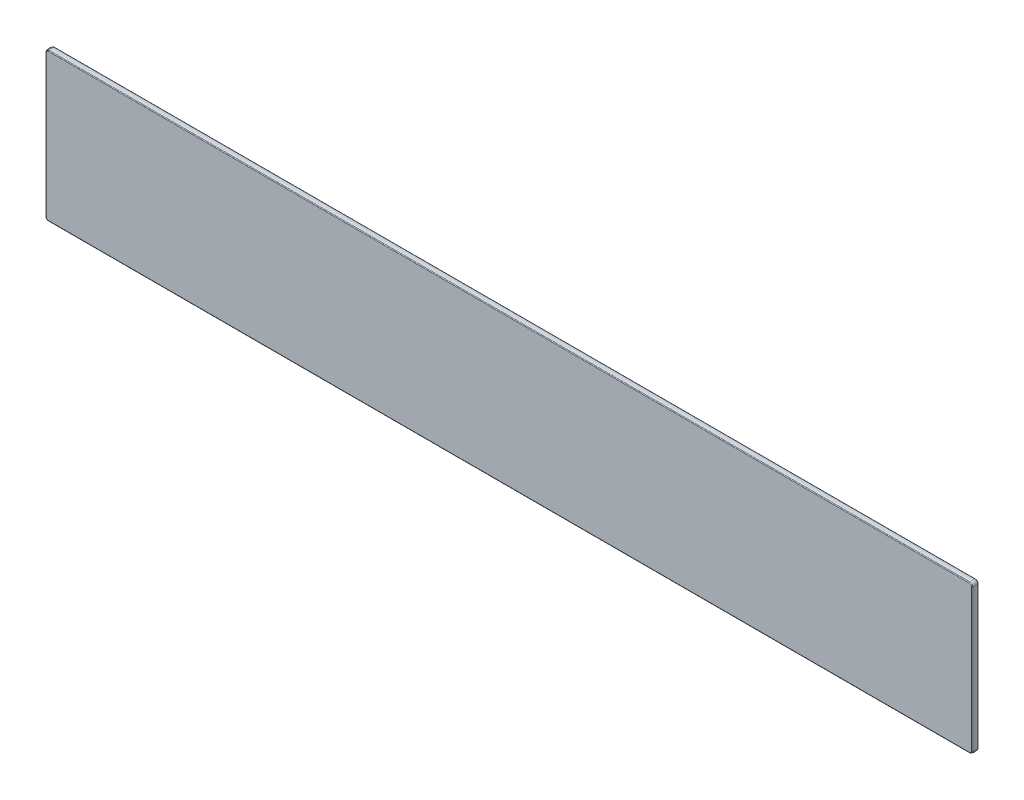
ISO-10303-21;
HEADER;
FILE_DESCRIPTION(('STEP AP214'),'2;1');
FILE_NAME('part.step','',(''),(''),'','','');
FILE_SCHEMA(('AUTOMOTIVE_DESIGN { 1 0 10303 214 1 1 1 1 }'));
ENDSEC;
DATA;
#1=APPLICATION_CONTEXT('core data for automotive mechanical design processes');
#2=APPLICATION_PROTOCOL_DEFINITION('international standard','automotive_design',2000,#1);
#3=PRODUCT_CONTEXT('',#1,'mechanical');
#4=PRODUCT('Part','Part','',(#3));
#5=PRODUCT_RELATED_PRODUCT_CATEGORY('part','',(#4));
#6=PRODUCT_DEFINITION_FORMATION('','',#4);
#7=PRODUCT_DEFINITION_CONTEXT('part definition',#1,'design');
#8=PRODUCT_DEFINITION('design','',#6,#7);
#9=PRODUCT_DEFINITION_SHAPE('','',#8);
#10=(LENGTH_UNIT() NAMED_UNIT(*) SI_UNIT(.MILLI.,.METRE.));
#11=(NAMED_UNIT(*) PLANE_ANGLE_UNIT() SI_UNIT($,.RADIAN.));
#12=(NAMED_UNIT(*) SI_UNIT($,.STERADIAN.) SOLID_ANGLE_UNIT());
#13=UNCERTAINTY_MEASURE_WITH_UNIT(LENGTH_MEASURE(1.E-05),#10,'distance_accuracy_value','');
#14=(GEOMETRIC_REPRESENTATION_CONTEXT(3) GLOBAL_UNCERTAINTY_ASSIGNED_CONTEXT((#13)) GLOBAL_UNIT_ASSIGNED_CONTEXT((#10,
#11,#12)) REPRESENTATION_CONTEXT('',''));
#15=CARTESIAN_POINT('',(0.,0.,0.));
#16=DIRECTION('',(0.,0.,1.));
#17=DIRECTION('',(1.,0.,0.));
#18=AXIS2_PLACEMENT_3D('',#15,#16,#17);
#19=CARTESIAN_POINT('',(0.000262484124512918,-104.420684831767,261.128074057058));
#20=DIRECTION('',(-3.16923956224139E-08,3.73783141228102E-09,1.));
#21=DIRECTION('',(-0.999999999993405,3.63158778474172E-06,-3.16924091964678E-08));
#22=AXIS2_PLACEMENT_3D('',#19,#20,#21);
#23=PLANE('',#22);
#24=CARTESIAN_POINT('',(294.500469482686,-47.4217543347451,261.128083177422));
#25=DIRECTION('',(-3.16923956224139E-08,3.73783141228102E-09,1.));
#26=DIRECTION('',(-3.63158778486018E-06,-0.999999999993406,3.73771631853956E-09));
#27=AXIS2_PLACEMENT_3D('',#24,#25,#26);
#28=CIRCLE('',#27,1.32455532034);
#29=CARTESIAN_POINT('',(295.825024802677,-47.421759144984,261.128083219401));
#30=VERTEX_POINT('',#29);
#31=CARTESIAN_POINT('',(294.500474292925,-46.0971990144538,261.128083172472));
#32=VERTEX_POINT('',#31);
#33=EDGE_CURVE('E37',#30,#32,#28,.T.);
#34=ORIENTED_EDGE('',*,*,#33,.F.);
#35=DIRECTION('',(-3.63158778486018E-06,-0.999999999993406,3.73771631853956E-09));
#36=VECTOR('',#35,1.);
#37=CARTESIAN_POINT('',(295.824859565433,-92.921759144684,261.128083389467));
#38=LINE('',#37,#36);
#39=CARTESIAN_POINT('',(295.824694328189,-138.421759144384,261.128083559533));
#40=VERTEX_POINT('',#39);
#41=EDGE_CURVE('E11',#30,#40,#38,.T.);
#42=ORIENTED_EDGE('',*,*,#41,.T.);
#43=CARTESIAN_POINT('',(294.500139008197,-138.421754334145,261.128083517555));
#44=DIRECTION('',(-3.16923956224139E-08,3.73783141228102E-09,1.));
#45=DIRECTION('',(-3.63158778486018E-06,-0.999999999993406,3.73771631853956E-09));
#46=AXIS2_PLACEMENT_3D('',#43,#44,#45);
#47=CIRCLE('',#46,1.32455532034);
#48=CARTESIAN_POINT('',(294.500134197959,-139.746309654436,261.128083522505));
#49=VERTEX_POINT('',#48);
#50=EDGE_CURVE('E281',#49,#40,#47,.T.);
#51=ORIENTED_EDGE('',*,*,#50,.F.);
#52=DIRECTION('',(-0.999999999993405,3.63158778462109E-06,-3.16924091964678E-08));
#53=VECTOR('',#52,1.);
#54=CARTESIAN_POINT('',(0.000134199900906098,-139.745240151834,261.128074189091));
#55=LINE('',#54,#53);
#56=CARTESIAN_POINT('',(-294.499865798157,-139.744170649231,261.128064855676));
#57=VERTEX_POINT('',#56);
#58=EDGE_CURVE('E29',#49,#57,#55,.T.);
#59=ORIENTED_EDGE('',*,*,#58,.T.);
#60=CARTESIAN_POINT('',(-294.499860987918,-138.41961532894,261.128064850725));
#61=DIRECTION('',(-3.16923956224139E-08,3.73783141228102E-09,1.));
#62=DIRECTION('',(-3.63158778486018E-06,-0.999999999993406,3.73771631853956E-09));
#63=AXIS2_PLACEMENT_3D('',#60,#61,#62);
#64=CIRCLE('',#63,1.32455532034);
#65=CARTESIAN_POINT('',(-295.824416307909,-138.419610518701,261.128064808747));
#66=VERTEX_POINT('',#65);
#67=EDGE_CURVE('E263',#66,#57,#64,.T.);
#68=ORIENTED_EDGE('',*,*,#67,.F.);
#69=DIRECTION('',(3.63158778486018E-06,0.999999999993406,-3.73771631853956E-09));
#70=VECTOR('',#69,1.);
#71=CARTESIAN_POINT('',(-295.824251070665,-92.9196105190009,261.128064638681));
#72=LINE('',#71,#70);
#73=CARTESIAN_POINT('',(-295.824085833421,-47.4196105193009,261.128064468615));
#74=VERTEX_POINT('',#73);
#75=EDGE_CURVE('E288',#66,#74,#72,.T.);
#76=ORIENTED_EDGE('',*,*,#75,.T.);
#77=CARTESIAN_POINT('',(-294.49953051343,-47.4196153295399,261.128064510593));
#78=DIRECTION('',(-3.16923956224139E-08,3.73783141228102E-09,1.));
#79=DIRECTION('',(-3.63158778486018E-06,-0.999999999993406,3.73771631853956E-09));
#80=AXIS2_PLACEMENT_3D('',#77,#78,#79);
#81=CIRCLE('',#80,1.32455532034);
#82=CARTESIAN_POINT('',(-294.49952570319,-46.0950600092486,261.128064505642));
#83=VERTEX_POINT('',#82);
#84=EDGE_CURVE('E294',#83,#74,#81,.T.);
#85=ORIENTED_EDGE('',*,*,#84,.F.);
#86=DIRECTION('',(0.999999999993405,-3.63158778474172E-06,3.16924091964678E-08));
#87=VECTOR('',#86,1.);
#88=CARTESIAN_POINT('',(0.000474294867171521,-46.0961295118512,261.128073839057));
#89=LINE('',#88,#87);
#90=EDGE_CURVE('E293',#83,#32,#89,.T.);
#91=ORIENTED_EDGE('',*,*,#90,.T.);
#92=EDGE_LOOP('',(#34,#42,#51,#59,#68,#76,#85,#91));
#93=FACE_BOUND('',#92,.T.);
#94=ADVANCED_FACE('F17',(#93),#23,.F.);
#95=CARTESIAN_POINT('',(0.000262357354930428,-104.420684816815,265.128074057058));
#96=DIRECTION('',(-3.16923956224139E-08,3.73783141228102E-09,1.));
#97=DIRECTION('',(-0.999999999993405,3.63158778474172E-06,-3.16924091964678E-08));
#98=AXIS2_PLACEMENT_3D('',#95,#96,#97);
#99=PLANE('',#98);
#100=DIRECTION('',(0.999999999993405,-3.63158778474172E-06,3.16924091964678E-08));
#101=VECTOR('',#100,1.);
#102=CARTESIAN_POINT('',(0.000474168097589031,-46.0961294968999,265.128073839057));
#103=LINE('',#102,#101);
#104=CARTESIAN_POINT('',(-294.49952582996,-46.0950599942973,265.128064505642));
#105=VERTEX_POINT('',#104);
#106=CARTESIAN_POINT('',(294.500474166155,-46.0971989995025,265.128083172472));
#107=VERTEX_POINT('',#106);
#108=EDGE_CURVE('E302',#105,#107,#103,.T.);
#109=ORIENTED_EDGE('',*,*,#108,.F.);
#110=CARTESIAN_POINT('',(-294.499530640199,-47.4196153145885,265.128064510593));
#111=DIRECTION('',(-3.16923956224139E-08,3.73783141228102E-09,1.));
#112=DIRECTION('',(-3.63158778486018E-06,-0.999999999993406,3.73771631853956E-09));
#113=AXIS2_PLACEMENT_3D('',#110,#111,#112);
#114=CIRCLE('',#113,1.32455532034);
#115=CARTESIAN_POINT('',(-295.82408596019,-47.4196105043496,265.128064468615));
#116=VERTEX_POINT('',#115);
#117=EDGE_CURVE('E301',#105,#116,#114,.T.);
#118=ORIENTED_EDGE('',*,*,#117,.T.);
#119=DIRECTION('',(3.63158778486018E-06,0.999999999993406,-3.73771631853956E-09));
#120=VECTOR('',#119,1.);
#121=CARTESIAN_POINT('',(-295.824251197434,-92.9196105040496,265.128064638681));
#122=LINE('',#121,#120);
#123=CARTESIAN_POINT('',(-295.824416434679,-138.41961050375,265.128064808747));
#124=VERTEX_POINT('',#123);
#125=EDGE_CURVE('E311',#124,#116,#122,.T.);
#126=ORIENTED_EDGE('',*,*,#125,.F.);
#127=CARTESIAN_POINT('',(-294.499861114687,-138.419615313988,265.128064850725));
#128=DIRECTION('',(-3.16923956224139E-08,3.73783141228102E-09,1.));
#129=DIRECTION('',(-3.63158778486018E-06,-0.999999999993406,3.73771631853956E-09));
#130=AXIS2_PLACEMENT_3D('',#127,#128,#129);
#131=CIRCLE('',#130,1.32455532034);
#132=CARTESIAN_POINT('',(-294.499865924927,-139.74417063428,265.128064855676));
#133=VERTEX_POINT('',#132);
#134=EDGE_CURVE('E310',#124,#133,#131,.T.);
#135=ORIENTED_EDGE('',*,*,#134,.T.);
#136=DIRECTION('',(-0.999999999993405,3.63158778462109E-06,-3.16924091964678E-08));
#137=VECTOR('',#136,1.);
#138=CARTESIAN_POINT('',(0.000134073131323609,-139.745240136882,265.128074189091));
#139=LINE('',#138,#137);
#140=CARTESIAN_POINT('',(294.500134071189,-139.746309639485,265.128083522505));
#141=VERTEX_POINT('',#140);
#142=EDGE_CURVE('E169',#141,#133,#139,.T.);
#143=ORIENTED_EDGE('',*,*,#142,.F.);
#144=CARTESIAN_POINT('',(294.500138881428,-138.421754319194,265.128083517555));
#145=DIRECTION('',(-3.16923956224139E-08,3.73783141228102E-09,1.));
#146=DIRECTION('',(-3.63158778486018E-06,-0.999999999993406,3.73771631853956E-09));
#147=AXIS2_PLACEMENT_3D('',#144,#145,#146);
#148=CIRCLE('',#147,1.32455532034);
#149=CARTESIAN_POINT('',(295.82469420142,-138.421759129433,265.128083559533));
#150=VERTEX_POINT('',#149);
#151=EDGE_CURVE('E318',#141,#150,#148,.T.);
#152=ORIENTED_EDGE('',*,*,#151,.T.);
#153=DIRECTION('',(-3.63158778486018E-06,-0.999999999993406,3.73771631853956E-09));
#154=VECTOR('',#153,1.);
#155=CARTESIAN_POINT('',(295.824859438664,-92.9217591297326,265.128083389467));
#156=LINE('',#155,#154);
#157=CARTESIAN_POINT('',(295.825024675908,-47.4217591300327,265.128083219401));
#158=VERTEX_POINT('',#157);
#159=EDGE_CURVE('E166',#158,#150,#156,.T.);
#160=ORIENTED_EDGE('',*,*,#159,.F.);
#161=CARTESIAN_POINT('',(294.500469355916,-47.4217543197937,265.128083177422));
#162=DIRECTION('',(-3.16923956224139E-08,3.73783141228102E-09,1.));
#163=DIRECTION('',(-3.63158778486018E-06,-0.999999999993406,3.73771631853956E-09));
#164=AXIS2_PLACEMENT_3D('',#161,#162,#163);
#165=CIRCLE('',#164,1.32455532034);
#166=EDGE_CURVE('E204',#158,#107,#165,.T.);
#167=ORIENTED_EDGE('',*,*,#166,.T.);
#168=EDGE_LOOP('',(#109,#118,#126,#135,#143,#152,#160,#167));
#169=FACE_BOUND('',#168,.T.);
#170=ADVANCED_FACE('F642',(#169),#99,.T.);
#171=CARTESIAN_POINT('',(-294.499530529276,-47.4196153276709,261.628064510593));
#172=DIRECTION('',(-3.16923956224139E-08,3.73783141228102E-09,1.));
#173=DIRECTION('',(-3.63158778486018E-06,-0.999999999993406,3.73771631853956E-09));
#174=AXIS2_PLACEMENT_3D('',#171,#172,#173);
#175=TOROIDAL_SURFACE('',#174,1.32455532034,0.5);
#176=CARTESIAN_POINT('',(-294.499530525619,-47.4196153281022,261.512679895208));
#177=DIRECTION('',(-3.16923956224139E-08,3.73783141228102E-09,1.));
#178=DIRECTION('',(-3.63158778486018E-06,-0.999999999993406,3.73771631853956E-09));
#179=AXIS2_PLACEMENT_3D('',#176,#177,#178);
#180=CIRCLE('',#179,1.81105957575);
#181=CARTESIAN_POINT('',(-294.499523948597,-45.6085557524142,261.512679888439));
#182=VERTEX_POINT('',#181);
#183=CARTESIAN_POINT('',(-296.310590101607,-47.4196087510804,261.512679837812));
#184=VERTEX_POINT('',#183);
#185=EDGE_CURVE('E149',#182,#184,#180,.T.);
#186=ORIENTED_EDGE('',*,*,#185,.F.);
#187=CARTESIAN_POINT('',(-294.499525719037,-46.0950600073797,261.628064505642));
#188=DIRECTION('',(-0.999999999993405,3.63158778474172E-06,-3.16924091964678E-08));
#189=DIRECTION('',(-3.16923956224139E-08,3.73783141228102E-09,1.));
#190=AXIS2_PLACEMENT_3D('',#187,#188,#189);
#191=CIRCLE('',#190,0.5);
#192=EDGE_CURVE('E297',#182,#83,#191,.T.);
#193=ORIENTED_EDGE('',*,*,#192,.T.);
#194=ORIENTED_EDGE('',*,*,#84,.T.);
#195=CARTESIAN_POINT('',(-295.824085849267,-47.419610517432,261.628064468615));
#196=DIRECTION('',(-3.63158777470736E-06,-0.999999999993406,3.73771631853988E-09));
#197=DIRECTION('',(-3.16923956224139E-08,3.73783141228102E-09,1.));
#198=AXIS2_PLACEMENT_3D('',#195,#196,#197);
#199=CIRCLE('',#198,0.5);
#200=EDGE_CURVE('E298',#184,#74,#199,.T.);
#201=ORIENTED_EDGE('',*,*,#200,.F.);
#202=EDGE_LOOP('',(#186,#193,#194,#201));
#203=FACE_BOUND('',#202,.T.);
#204=ADVANCED_FACE('F628',(#203),#175,.T.);
#205=CARTESIAN_POINT('',(-295.824251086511,-92.919610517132,261.628064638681));
#206=DIRECTION('',(3.63158778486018E-06,0.999999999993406,-3.73771631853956E-09));
#207=DIRECTION('',(-3.16923956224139E-08,3.73783141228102E-09,1.));
#208=AXIS2_PLACEMENT_3D('',#205,#206,#207);
#209=CYLINDRICAL_SURFACE('',#208,0.5);
#210=ORIENTED_EDGE('',*,*,#200,.T.);
#211=ORIENTED_EDGE('',*,*,#75,.F.);
#212=CARTESIAN_POINT('',(-295.824416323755,-138.419610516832,261.628064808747));
#213=DIRECTION('',(-3.63158778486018E-06,-0.999999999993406,3.73771631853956E-09));
#214=DIRECTION('',(-3.16923956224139E-08,3.73783141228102E-09,1.));
#215=AXIS2_PLACEMENT_3D('',#212,#213,#214);
#216=CIRCLE('',#215,0.5);
#217=CARTESIAN_POINT('',(-296.310920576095,-138.41960875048,261.512680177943));
#218=VERTEX_POINT('',#217);
#219=EDGE_CURVE('E270',#218,#66,#216,.T.);
#220=ORIENTED_EDGE('',*,*,#219,.F.);
#221=DIRECTION('',(3.63158778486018E-06,0.999999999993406,-3.73771631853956E-09));
#222=VECTOR('',#221,1.);
#223=CARTESIAN_POINT('',(-296.310755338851,-92.9196087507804,261.512680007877));
#224=LINE('',#223,#222);
#225=EDGE_CURVE('E526',#218,#184,#224,.T.);
#226=ORIENTED_EDGE('',*,*,#225,.T.);
#227=EDGE_LOOP('',(#210,#211,#220,#226));
#228=FACE_BOUND('',#227,.T.);
#229=ADVANCED_FACE('F625',(#228),#209,.T.);
#230=CARTESIAN_POINT('',(0.00047427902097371,-46.0961295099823,261.628073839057));
#231=DIRECTION('',(0.999999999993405,-3.63158778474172E-06,3.16924091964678E-08));
#232=DIRECTION('',(-3.16923956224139E-08,3.73783141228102E-09,1.));
#233=AXIS2_PLACEMENT_3D('',#230,#231,#232);
#234=CYLINDRICAL_SURFACE('',#233,0.5);
#235=CARTESIAN_POINT('',(294.500474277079,-46.0971990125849,261.628083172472));
#236=DIRECTION('',(-0.999999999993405,3.63158778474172E-06,-3.16924091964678E-08));
#237=DIRECTION('',(-3.16923956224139E-08,3.73783141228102E-09,1.));
#238=AXIS2_PLACEMENT_3D('',#235,#236,#237);
#239=CIRCLE('',#238,0.5);
#240=CARTESIAN_POINT('',(294.500476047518,-45.6106947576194,261.512698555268));
#241=VERTEX_POINT('',#240);
#242=EDGE_CURVE('E520',#241,#32,#239,.T.);
#243=ORIENTED_EDGE('',*,*,#242,.T.);
#244=ORIENTED_EDGE('',*,*,#90,.F.);
#245=ORIENTED_EDGE('',*,*,#192,.F.);
#246=DIRECTION('',(0.999999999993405,-3.63158778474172E-06,3.16924091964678E-08));
#247=VECTOR('',#246,1.);
#248=CARTESIAN_POINT('',(0.000476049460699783,-45.6096252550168,261.512689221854));
#249=LINE('',#248,#247);
#250=EDGE_CURVE('E517',#182,#241,#249,.T.);
#251=ORIENTED_EDGE('',*,*,#250,.T.);
#252=EDGE_LOOP('',(#243,#244,#245,#251));
#253=FACE_BOUND('',#252,.T.);
#254=ADVANCED_FACE('F654',(#253),#234,.T.);
#255=CARTESIAN_POINT('',(-294.499861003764,-138.419615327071,261.628064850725));
#256=DIRECTION('',(-3.16923956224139E-08,3.73783141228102E-09,1.));
#257=DIRECTION('',(0.999999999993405,-3.63158778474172E-06,3.16924091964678E-08));
#258=AXIS2_PLACEMENT_3D('',#255,#256,#257);
#259=TOROIDAL_SURFACE('',#258,1.32455532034,0.5);
#260=CARTESIAN_POINT('',(-294.499861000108,-138.419615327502,261.51268023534));
#261=DIRECTION('',(-3.16923956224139E-08,3.73783141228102E-09,1.));
#262=DIRECTION('',(-3.63158778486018E-06,-0.999999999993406,3.73771631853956E-09));
#263=AXIS2_PLACEMENT_3D('',#260,#261,#262);
#264=CIRCLE('',#263,1.81105957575);
#265=CARTESIAN_POINT('',(-294.499867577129,-140.23067490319,261.512680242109));
#266=VERTEX_POINT('',#265);
#267=EDGE_CURVE('E383',#218,#266,#264,.T.);
#268=ORIENTED_EDGE('',*,*,#267,.F.);
#269=ORIENTED_EDGE('',*,*,#219,.T.);
#270=ORIENTED_EDGE('',*,*,#67,.T.);
#271=CARTESIAN_POINT('',(-294.499865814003,-139.744170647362,261.628064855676));
#272=DIRECTION('',(0.999999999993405,-3.63158779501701E-06,3.16924091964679E-08));
#273=DIRECTION('',(-3.16923956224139E-08,3.73783141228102E-09,1.));
#274=AXIS2_PLACEMENT_3D('',#271,#272,#273);
#275=CIRCLE('',#274,0.5);
#276=EDGE_CURVE('E272',#266,#57,#275,.T.);
#277=ORIENTED_EDGE('',*,*,#276,.F.);
#278=EDGE_LOOP('',(#268,#269,#270,#277));
#279=FACE_BOUND('',#278,.T.);
#280=ADVANCED_FACE('F634',(#279),#259,.T.);
#281=CARTESIAN_POINT('',(294.50046946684,-47.4217543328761,261.628083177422));
#282=DIRECTION('',(-3.16923956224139E-08,3.73783141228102E-09,1.));
#283=DIRECTION('',(-0.999999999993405,3.63158778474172E-06,-3.16924091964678E-08));
#284=AXIS2_PLACEMENT_3D('',#281,#282,#283);
#285=TOROIDAL_SURFACE('',#284,1.32455532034,0.5);
#286=CARTESIAN_POINT('',(294.500469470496,-47.4217543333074,261.512698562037));
#287=DIRECTION('',(-3.16923956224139E-08,3.73783141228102E-09,1.));
#288=DIRECTION('',(-3.63158778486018E-06,-0.999999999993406,3.73771631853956E-09));
#289=AXIS2_PLACEMENT_3D('',#286,#287,#288);
#290=CIRCLE('',#289,1.81105957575);
#291=CARTESIAN_POINT('',(296.311529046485,-47.4217609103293,261.512698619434));
#292=VERTEX_POINT('',#291);
#293=EDGE_CURVE('E506',#292,#241,#290,.T.);
#294=ORIENTED_EDGE('',*,*,#293,.F.);
#295=CARTESIAN_POINT('',(295.825024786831,-47.4217591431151,261.628083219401));
#296=DIRECTION('',(3.63158778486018E-06,0.999999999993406,-3.73771631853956E-09));
#297=DIRECTION('',(3.16923956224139E-08,-3.73783141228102E-09,-1.));
#298=AXIS2_PLACEMENT_3D('',#295,#296,#297);
#299=CIRCLE('',#298,0.5);
#300=EDGE_CURVE('E260',#292,#30,#299,.T.);
#301=ORIENTED_EDGE('',*,*,#300,.T.);
#302=ORIENTED_EDGE('',*,*,#33,.T.);
#303=ORIENTED_EDGE('',*,*,#242,.F.);
#304=EDGE_LOOP('',(#294,#301,#302,#303));
#305=FACE_BOUND('',#304,.T.);
#306=ADVANCED_FACE('F660',(#305),#285,.T.);
#307=CARTESIAN_POINT('',(0.000134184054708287,-139.745240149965,261.628074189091));
#308=DIRECTION('',(-0.999999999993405,3.63158778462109E-06,-3.16924091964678E-08));
#309=DIRECTION('',(-3.16923956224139E-08,3.73783141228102E-09,1.));
#310=AXIS2_PLACEMENT_3D('',#307,#308,#309);
#311=CYLINDRICAL_SURFACE('',#310,0.5);
#312=ORIENTED_EDGE('',*,*,#276,.T.);
#313=ORIENTED_EDGE('',*,*,#58,.F.);
#314=CARTESIAN_POINT('',(294.500134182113,-139.746309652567,261.628083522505));
#315=DIRECTION('',(0.999999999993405,-3.63158778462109E-06,3.16924091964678E-08));
#316=DIRECTION('',(-3.16923956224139E-08,3.73783141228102E-09,1.));
#317=AXIS2_PLACEMENT_3D('',#314,#315,#316);
#318=CIRCLE('',#317,0.5);
#319=CARTESIAN_POINT('',(294.500132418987,-140.232813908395,261.512698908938));
#320=VERTEX_POINT('',#319);
#321=EDGE_CURVE('E284',#320,#49,#318,.T.);
#322=ORIENTED_EDGE('',*,*,#321,.F.);
#323=DIRECTION('',(-0.999999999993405,3.63158778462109E-06,-3.16924091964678E-08));
#324=VECTOR('',#323,1.);
#325=CARTESIAN_POINT('',(0.000132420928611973,-140.231744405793,261.512689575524));
#326=LINE('',#325,#324);
#327=EDGE_CURVE('E278',#320,#266,#326,.T.);
#328=ORIENTED_EDGE('',*,*,#327,.T.);
#329=EDGE_LOOP('',(#312,#313,#322,#328));
#330=FACE_BOUND('',#329,.T.);
#331=ADVANCED_FACE('F663',(#330),#311,.T.);
#332=CARTESIAN_POINT('',(295.824859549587,-92.921759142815,261.628083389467));
#333=DIRECTION('',(-3.63158778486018E-06,-0.999999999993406,3.73771631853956E-09));
#334=DIRECTION('',(-3.16923956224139E-08,3.73783141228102E-09,1.));
#335=AXIS2_PLACEMENT_3D('',#332,#333,#334);
#336=CYLINDRICAL_SURFACE('',#335,0.5);
#337=CARTESIAN_POINT('',(295.824694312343,-138.421759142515,261.628083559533));
#338=DIRECTION('',(3.63158778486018E-06,0.999999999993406,-3.73771631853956E-09));
#339=DIRECTION('',(3.16923956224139E-08,-3.73783141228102E-09,-1.));
#340=AXIS2_PLACEMENT_3D('',#337,#338,#339);
#341=CIRCLE('',#340,0.5);
#342=CARTESIAN_POINT('',(296.311198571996,-138.421760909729,261.512698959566));
#343=VERTEX_POINT('',#342);
#344=EDGE_CURVE('E346',#343,#40,#341,.T.);
#345=ORIENTED_EDGE('',*,*,#344,.T.);
#346=ORIENTED_EDGE('',*,*,#41,.F.);
#347=ORIENTED_EDGE('',*,*,#300,.F.);
#348=DIRECTION('',(-3.63158778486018E-06,-0.999999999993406,3.73771631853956E-09));
#349=VECTOR('',#348,1.);
#350=CARTESIAN_POINT('',(296.311363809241,-92.9217609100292,261.5126987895));
#351=LINE('',#350,#349);
#352=EDGE_CURVE('E340',#292,#343,#351,.T.);
#353=ORIENTED_EDGE('',*,*,#352,.T.);
#354=EDGE_LOOP('',(#345,#346,#347,#353));
#355=FACE_BOUND('',#354,.T.);
#356=ADVANCED_FACE('F666',(#355),#336,.T.);
#357=CARTESIAN_POINT('',(294.500138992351,-138.421754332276,261.628083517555));
#358=DIRECTION('',(-3.16923956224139E-08,3.73783141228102E-09,1.));
#359=DIRECTION('',(3.63158778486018E-06,0.999999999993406,-3.73771631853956E-09));
#360=AXIS2_PLACEMENT_3D('',#357,#358,#359);
#361=TOROIDAL_SURFACE('',#360,1.32455532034,0.5);
#362=CARTESIAN_POINT('',(294.500138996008,-138.421754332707,261.51269890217));
#363=DIRECTION('',(-3.16923956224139E-08,3.73783141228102E-09,1.));
#364=DIRECTION('',(-3.63158778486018E-06,-0.999999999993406,3.73771631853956E-09));
#365=AXIS2_PLACEMENT_3D('',#362,#363,#364);
#366=CIRCLE('',#365,1.81105957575);
#367=EDGE_CURVE('E173',#320,#343,#366,.T.);
#368=ORIENTED_EDGE('',*,*,#367,.F.);
#369=ORIENTED_EDGE('',*,*,#321,.T.);
#370=ORIENTED_EDGE('',*,*,#50,.T.);
#371=ORIENTED_EDGE('',*,*,#344,.F.);
#372=EDGE_LOOP('',(#368,#369,#370,#371));
#373=FACE_BOUND('',#372,.T.);
#374=ADVANCED_FACE('F670',(#373),#361,.T.);
#375=CARTESIAN_POINT('',(-294.499530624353,-47.4196153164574,264.628064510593));
#376=DIRECTION('',(-3.16923956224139E-08,3.73783141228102E-09,1.));
#377=DIRECTION('',(-3.63158778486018E-06,-0.999999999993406,3.73771631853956E-09));
#378=AXIS2_PLACEMENT_3D('',#375,#376,#377);
#379=TOROIDAL_SURFACE('',#378,1.32455532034,0.5);
#380=ORIENTED_EDGE('',*,*,#117,.F.);
#381=CARTESIAN_POINT('',(-294.499525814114,-46.0950599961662,264.628064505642));
#382=DIRECTION('',(-0.999999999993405,3.63158778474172E-06,-3.16924091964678E-08));
#383=DIRECTION('',(-3.16923956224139E-08,3.73783141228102E-09,1.));
#384=AXIS2_PLACEMENT_3D('',#381,#382,#383);
#385=CIRCLE('',#384,0.5);
#386=CARTESIAN_POINT('',(-294.499524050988,-45.6085557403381,264.743449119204));
#387=VERTEX_POINT('',#386);
#388=EDGE_CURVE('E285',#105,#387,#385,.T.);
#389=ORIENTED_EDGE('',*,*,#388,.T.);
#390=CARTESIAN_POINT('',(-294.499530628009,-47.4196153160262,264.743449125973));
#391=DIRECTION('',(-3.16923956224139E-08,3.73783141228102E-09,1.));
#392=DIRECTION('',(-3.63158778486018E-06,-0.999999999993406,3.73771631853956E-09));
#393=AXIS2_PLACEMENT_3D('',#390,#391,#392);
#394=CIRCLE('',#393,1.81105957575);
#395=CARTESIAN_POINT('',(-296.310590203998,-47.4196087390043,264.743449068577));
#396=VERTEX_POINT('',#395);
#397=EDGE_CURVE('E419',#387,#396,#394,.T.);
#398=ORIENTED_EDGE('',*,*,#397,.T.);
#399=CARTESIAN_POINT('',(-295.824085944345,-47.4196105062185,264.628064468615));
#400=DIRECTION('',(-3.63158777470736E-06,-0.999999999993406,3.73771631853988E-09));
#401=DIRECTION('',(-3.16923956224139E-08,3.73783141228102E-09,1.));
#402=AXIS2_PLACEMENT_3D('',#399,#400,#401);
#403=CIRCLE('',#402,0.5);
#404=EDGE_CURVE('E314',#116,#396,#403,.T.);
#405=ORIENTED_EDGE('',*,*,#404,.F.);
#406=EDGE_LOOP('',(#380,#389,#398,#405));
#407=FACE_BOUND('',#406,.T.);
#408=ADVANCED_FACE('F674',(#407),#379,.T.);
#409=CARTESIAN_POINT('',(-295.824251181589,-92.9196105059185,264.628064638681));
#410=DIRECTION('',(3.63158778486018E-06,0.999999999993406,-3.73771631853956E-09));
#411=DIRECTION('',(0.973008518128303,-3.53442839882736E-06,-0.230769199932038));
#412=AXIS2_PLACEMENT_3D('',#409,#410,#411);
#413=CYLINDRICAL_SURFACE('',#412,0.5);
#414=ORIENTED_EDGE('',*,*,#404,.T.);
#415=DIRECTION('',(3.63158778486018E-06,0.999999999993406,-3.73771631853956E-09));
#416=VECTOR('',#415,1.);
#417=CARTESIAN_POINT('',(-296.310755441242,-92.9196087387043,264.743449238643));
#418=LINE('',#417,#416);
#419=CARTESIAN_POINT('',(-296.310920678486,-138.419608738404,264.743449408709));
#420=VERTEX_POINT('',#419);
#421=EDGE_CURVE('E543',#420,#396,#418,.T.);
#422=ORIENTED_EDGE('',*,*,#421,.F.);
#423=CARTESIAN_POINT('',(-295.824416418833,-138.419610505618,264.628064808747));
#424=DIRECTION('',(-3.63158778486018E-06,-0.999999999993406,3.73771631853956E-09));
#425=DIRECTION('',(-3.16923956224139E-08,3.73783141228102E-09,1.));
#426=AXIS2_PLACEMENT_3D('',#423,#424,#425);
#427=CIRCLE('',#426,0.5);
#428=EDGE_CURVE('E306',#124,#420,#427,.T.);
#429=ORIENTED_EDGE('',*,*,#428,.F.);
#430=ORIENTED_EDGE('',*,*,#125,.T.);
#431=EDGE_LOOP('',(#414,#422,#429,#430));
#432=FACE_BOUND('',#431,.T.);
#433=ADVANCED_FACE('F678',(#432),#413,.T.);
#434=CARTESIAN_POINT('',(0.000474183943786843,-46.0961294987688,264.628073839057));
#435=DIRECTION('',(0.999999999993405,-3.63158778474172E-06,3.16924091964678E-08));
#436=DIRECTION('',(-3.52625219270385E-06,-0.97300851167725,-0.230769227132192));
#437=AXIS2_PLACEMENT_3D('',#434,#435,#436);
#438=CYLINDRICAL_SURFACE('',#437,0.5);
#439=CARTESIAN_POINT('',(294.500474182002,-46.0971990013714,264.628083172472));
#440=DIRECTION('',(-0.999999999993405,3.63158778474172E-06,-3.16924091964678E-08));
#441=DIRECTION('',(-3.16923956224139E-08,3.73783141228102E-09,1.));
#442=AXIS2_PLACEMENT_3D('',#439,#440,#441);
#443=CIRCLE('',#442,0.5);
#444=CARTESIAN_POINT('',(294.500475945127,-45.6106947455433,264.743467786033));
#445=VERTEX_POINT('',#444);
#446=EDGE_CURVE('E305',#107,#445,#443,.T.);
#447=ORIENTED_EDGE('',*,*,#446,.T.);
#448=DIRECTION('',(0.999999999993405,-3.63158778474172E-06,3.16924091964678E-08));
#449=VECTOR('',#448,1.);
#450=CARTESIAN_POINT('',(0.000475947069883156,-45.6096252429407,264.743458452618));
#451=LINE('',#450,#449);
#452=EDGE_CURVE('E387',#387,#445,#451,.T.);
#453=ORIENTED_EDGE('',*,*,#452,.F.);
#454=ORIENTED_EDGE('',*,*,#388,.F.);
#455=ORIENTED_EDGE('',*,*,#108,.T.);
#456=EDGE_LOOP('',(#447,#453,#454,#455));
#457=FACE_BOUND('',#456,.T.);
#458=ADVANCED_FACE('F598',(#457),#438,.T.);
#459=CARTESIAN_POINT('',(-294.499861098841,-138.419615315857,264.628064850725));
#460=DIRECTION('',(-3.16923956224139E-08,3.73783141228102E-09,1.));
#461=DIRECTION('',(0.999999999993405,-3.63158778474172E-06,3.16924091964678E-08));
#462=AXIS2_PLACEMENT_3D('',#459,#460,#461);
#463=TOROIDAL_SURFACE('',#462,1.32455532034,0.5);
#464=ORIENTED_EDGE('',*,*,#134,.F.);
#465=ORIENTED_EDGE('',*,*,#428,.T.);
#466=CARTESIAN_POINT('',(-294.499861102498,-138.419615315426,264.743449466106));
#467=DIRECTION('',(-3.16923956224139E-08,3.73783141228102E-09,1.));
#468=DIRECTION('',(-3.63158778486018E-06,-0.999999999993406,3.73771631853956E-09));
#469=AXIS2_PLACEMENT_3D('',#466,#467,#468);
#470=CIRCLE('',#469,1.81105957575);
#471=CARTESIAN_POINT('',(-294.49986767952,-140.230674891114,264.743449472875));
#472=VERTEX_POINT('',#471);
#473=EDGE_CURVE('E257',#420,#472,#470,.T.);
#474=ORIENTED_EDGE('',*,*,#473,.T.);
#475=CARTESIAN_POINT('',(-294.49986590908,-139.744170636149,264.628064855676));
#476=DIRECTION('',(0.999999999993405,-3.63158779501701E-06,3.16924091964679E-08));
#477=DIRECTION('',(-3.16923956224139E-08,3.73783141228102E-09,1.));
#478=AXIS2_PLACEMENT_3D('',#475,#476,#477);
#479=CIRCLE('',#478,0.5);
#480=EDGE_CURVE('E321',#133,#472,#479,.T.);
#481=ORIENTED_EDGE('',*,*,#480,.F.);
#482=EDGE_LOOP('',(#464,#465,#474,#481));
#483=FACE_BOUND('',#482,.T.);
#484=ADVANCED_FACE('F685',(#483),#463,.T.);
#485=CARTESIAN_POINT('',(294.500469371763,-47.4217543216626,264.628083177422));
#486=DIRECTION('',(-3.16923956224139E-08,3.73783141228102E-09,1.));
#487=DIRECTION('',(-0.999999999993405,3.63158778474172E-06,-3.16924091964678E-08));
#488=AXIS2_PLACEMENT_3D('',#485,#486,#487);
#489=TOROIDAL_SURFACE('',#488,1.32455532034,0.5);
#490=ORIENTED_EDGE('',*,*,#166,.F.);
#491=CARTESIAN_POINT('',(295.825024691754,-47.4217591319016,264.628083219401));
#492=DIRECTION('',(3.63158778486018E-06,0.999999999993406,-3.73771631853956E-09));
#493=DIRECTION('',(3.16923956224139E-08,-3.73783141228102E-09,-1.));
#494=AXIS2_PLACEMENT_3D('',#491,#492,#493);
#495=CIRCLE('',#494,0.5);
#496=CARTESIAN_POINT('',(296.311528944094,-47.4217608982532,264.743467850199));
#497=VERTEX_POINT('',#496);
#498=EDGE_CURVE('E248',#158,#497,#495,.T.);
#499=ORIENTED_EDGE('',*,*,#498,.T.);
#500=CARTESIAN_POINT('',(294.500469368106,-47.4217543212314,264.743467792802));
#501=DIRECTION('',(-3.16923956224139E-08,3.73783141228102E-09,1.));
#502=DIRECTION('',(-3.63158778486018E-06,-0.999999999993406,3.73771631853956E-09));
#503=AXIS2_PLACEMENT_3D('',#500,#501,#502);
#504=CIRCLE('',#503,1.81105957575);
#505=EDGE_CURVE('E258',#497,#445,#504,.T.);
#506=ORIENTED_EDGE('',*,*,#505,.T.);
#507=ORIENTED_EDGE('',*,*,#446,.F.);
#508=EDGE_LOOP('',(#490,#499,#506,#507));
#509=FACE_BOUND('',#508,.T.);
#510=ADVANCED_FACE('F603',(#509),#489,.T.);
#511=CARTESIAN_POINT('',(0.00013408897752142,-139.745240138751,264.628074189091));
#512=DIRECTION('',(-0.999999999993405,3.63158778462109E-06,-3.16924091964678E-08));
#513=DIRECTION('',(3.5408794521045E-06,0.973008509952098,-0.230769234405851));
#514=AXIS2_PLACEMENT_3D('',#511,#512,#513);
#515=CYLINDRICAL_SURFACE('',#514,0.5);
#516=ORIENTED_EDGE('',*,*,#480,.T.);
#517=DIRECTION('',(-0.999999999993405,3.63158778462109E-06,-3.16924091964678E-08));
#518=VECTOR('',#517,1.);
#519=CARTESIAN_POINT('',(0.000132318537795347,-140.231744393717,264.743458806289));
#520=LINE('',#519,#518);
#521=CARTESIAN_POINT('',(294.500132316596,-140.232813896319,264.743468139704));
#522=VERTEX_POINT('',#521);
#523=EDGE_CURVE('E129',#522,#472,#520,.T.);
#524=ORIENTED_EDGE('',*,*,#523,.F.);
#525=CARTESIAN_POINT('',(294.500134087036,-139.746309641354,264.628083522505));
#526=DIRECTION('',(0.999999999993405,-3.63158778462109E-06,3.16924091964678E-08));
#527=DIRECTION('',(-3.16923956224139E-08,3.73783141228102E-09,1.));
#528=AXIS2_PLACEMENT_3D('',#525,#526,#527);
#529=CIRCLE('',#528,0.5);
#530=EDGE_CURVE('E158',#141,#522,#529,.T.);
#531=ORIENTED_EDGE('',*,*,#530,.F.);
#532=ORIENTED_EDGE('',*,*,#142,.T.);
#533=EDGE_LOOP('',(#516,#524,#531,#532));
#534=FACE_BOUND('',#533,.T.);
#535=ADVANCED_FACE('F691',(#534),#515,.T.);
#536=CARTESIAN_POINT('',(295.824859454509,-92.9217591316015,264.628083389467));
#537=DIRECTION('',(-3.63158778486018E-06,-0.999999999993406,3.73771631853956E-09));
#538=DIRECTION('',(-0.973008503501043,3.53270324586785E-06,-0.230769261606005));
#539=AXIS2_PLACEMENT_3D('',#536,#537,#538);
#540=CYLINDRICAL_SURFACE('',#539,0.5);
#541=CARTESIAN_POINT('',(295.824694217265,-138.421759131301,264.628083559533));
#542=DIRECTION('',(3.63158778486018E-06,0.999999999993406,-3.73771631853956E-09));
#543=DIRECTION('',(3.16923956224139E-08,-3.73783141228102E-09,-1.));
#544=AXIS2_PLACEMENT_3D('',#541,#542,#543);
#545=CIRCLE('',#544,0.5);
#546=CARTESIAN_POINT('',(296.311198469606,-138.421760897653,264.743468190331));
#547=VERTEX_POINT('',#546);
#548=EDGE_CURVE('E157',#150,#547,#545,.T.);
#549=ORIENTED_EDGE('',*,*,#548,.T.);
#550=DIRECTION('',(-3.63158778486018E-06,-0.999999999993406,3.73771631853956E-09));
#551=VECTOR('',#550,1.);
#552=CARTESIAN_POINT('',(296.31136370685,-92.9217608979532,264.743468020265));
#553=LINE('',#552,#551);
#554=EDGE_CURVE('E135',#497,#547,#553,.T.);
#555=ORIENTED_EDGE('',*,*,#554,.F.);
#556=ORIENTED_EDGE('',*,*,#498,.F.);
#557=ORIENTED_EDGE('',*,*,#159,.T.);
#558=EDGE_LOOP('',(#549,#555,#556,#557));
#559=FACE_BOUND('',#558,.T.);
#560=ADVANCED_FACE('F165',(#559),#540,.T.);
#561=CARTESIAN_POINT('',(294.500138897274,-138.421754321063,264.628083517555));
#562=DIRECTION('',(-3.16923956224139E-08,3.73783141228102E-09,1.));
#563=DIRECTION('',(3.63158778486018E-06,0.999999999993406,-3.73771631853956E-09));
#564=AXIS2_PLACEMENT_3D('',#561,#562,#563);
#565=TOROIDAL_SURFACE('',#564,1.32455532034,0.5);
#566=ORIENTED_EDGE('',*,*,#151,.F.);
#567=ORIENTED_EDGE('',*,*,#530,.T.);
#568=CARTESIAN_POINT('',(294.500138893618,-138.421754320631,264.743468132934));
#569=DIRECTION('',(-3.16923956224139E-08,3.73783141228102E-09,1.));
#570=DIRECTION('',(-3.63158778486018E-06,-0.999999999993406,3.73771631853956E-09));
#571=AXIS2_PLACEMENT_3D('',#568,#569,#570);
#572=CIRCLE('',#571,1.81105957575);
#573=EDGE_CURVE('E154',#522,#547,#572,.T.);
#574=ORIENTED_EDGE('',*,*,#573,.T.);
#575=ORIENTED_EDGE('',*,*,#548,.F.);
#576=EDGE_LOOP('',(#566,#567,#574,#575));
#577=FACE_BOUND('',#576,.T.);
#578=ADVANCED_FACE('F156',(#577),#565,.T.);
#579=CARTESIAN_POINT('',(294.500132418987,-140.232813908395,261.512698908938));
#580=CARTESIAN_POINT('',(294.500131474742,-140.483595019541,262.570084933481));
#581=CARTESIAN_POINT('',(294.500131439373,-140.48359501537,263.686082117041));
#582=CARTESIAN_POINT('',(294.500132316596,-140.232813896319,264.743468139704));
#583=B_SPLINE_CURVE_WITH_KNOTS('',3,(#579,#580,#581,#582),.UNSPECIFIED.,.F.,.F.,(4,4),(0.,1.),.UNSPECIFIED.);
#584=CARTESIAN_POINT('',(294.500138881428,-138.421754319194,265.128083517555));
#585=DIRECTION('',(-3.16923956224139E-08,3.73783141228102E-09,1.));
#586=AXIS1_PLACEMENT('',#584,#585);
#587=SURFACE_OF_REVOLUTION('',#583,#586);
#588=CARTESIAN_POINT('',(294.500132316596,-140.232813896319,264.743468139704));
#589=CARTESIAN_POINT('',(294.500132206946,-140.264160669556,264.611300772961));
#590=CARTESIAN_POINT('',(294.500132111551,-140.291590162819,264.478209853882));
#591=CARTESIAN_POINT('',(294.500131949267,-140.338611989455,264.21065428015));
#592=CARTESIAN_POINT('',(294.500131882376,-140.358204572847,264.076189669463));
#593=CARTESIAN_POINT('',(294.500131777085,-140.389552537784,263.806346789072));
#594=CARTESIAN_POINT('',(294.500131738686,-140.401307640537,263.670968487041));
#595=CARTESIAN_POINT('',(294.500131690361,-140.416981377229,263.399754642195));
#596=CARTESIAN_POINT('',(294.500131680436,-140.420899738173,263.263919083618));
#597=CARTESIAN_POINT('',(294.500131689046,-140.420899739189,262.992247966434));
#598=CARTESIAN_POINT('',(294.500131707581,-140.41698137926,262.856412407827));
#599=CARTESIAN_POINT('',(294.500131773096,-140.401307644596,262.585198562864));
#600=CARTESIAN_POINT('',(294.500131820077,-140.389552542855,262.449820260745));
#601=CARTESIAN_POINT('',(294.500131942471,-140.358204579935,262.179977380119));
#602=CARTESIAN_POINT('',(294.500132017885,-140.338611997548,262.045512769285));
#603=CARTESIAN_POINT('',(294.500132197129,-140.291590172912,261.777957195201));
#604=CARTESIAN_POINT('',(294.500132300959,-140.264160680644,261.644866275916));
#605=CARTESIAN_POINT('',(294.500132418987,-140.232813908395,261.512698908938));
#606=B_SPLINE_CURVE_WITH_KNOTS('',3,(#588,#589,#590,#591,#592,#593,#594,#595,#596,#597,#598,
#599,#600,#601,#602,#603,#604,#605),.UNSPECIFIED.,.F.,.F.,(4,2,2,2,2,2,2,2,4),(0.,
0.407434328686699,0.814855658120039,1.22229147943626,1.62974149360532,2.0371915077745,
2.44462732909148,2.85204865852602,3.25948298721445),.UNSPECIFIED.);
#607=EDGE_CURVE('E163',#522,#320,#606,.T.);
#608=ORIENTED_EDGE('',*,*,#607,.T.);
#609=ORIENTED_EDGE('',*,*,#367,.T.);
#610=CARTESIAN_POINT('',(296.311198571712,-138.421760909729,261.512698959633));
#611=CARTESIAN_POINT('',(296.342545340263,-138.421761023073,261.644866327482));
#612=CARTESIAN_POINT('',(296.369974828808,-138.421761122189,261.777957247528));
#613=CARTESIAN_POINT('',(296.416996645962,-138.421761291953,262.045512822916));
#614=CARTESIAN_POINT('',(296.436589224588,-138.421761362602,262.179977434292));
#615=CARTESIAN_POINT('',(296.467937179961,-138.421761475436,262.449820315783));
#616=CARTESIAN_POINT('',(296.479692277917,-138.42176151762,262.585198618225));
#617=CARTESIAN_POINT('',(296.495366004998,-138.421761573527,262.856412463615));
#618=CARTESIAN_POINT('',(296.49928436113,-138.421761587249,262.992248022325));
#619=CARTESIAN_POINT('',(296.49928435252,-138.421761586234,263.263919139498));
#620=CARTESIAN_POINT('',(296.495365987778,-138.421761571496,263.39975469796));
#621=CARTESIAN_POINT('',(296.479692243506,-138.421761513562,263.670968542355));
#622=CARTESIAN_POINT('',(296.46793713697,-138.421761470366,263.806346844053));
#623=CARTESIAN_POINT('',(296.436589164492,-138.421761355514,264.076189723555));
#624=CARTESIAN_POINT('',(296.416996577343,-138.42176128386,264.210654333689));
#625=CARTESIAN_POINT('',(296.369974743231,-138.421761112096,264.478209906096));
#626=CARTESIAN_POINT('',(296.34254524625,-138.421761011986,264.611300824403));
#627=CARTESIAN_POINT('',(296.311198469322,-138.421760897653,264.743468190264));
#628=B_SPLINE_CURVE_WITH_KNOTS('',3,(#610,#611,#612,#613,#614,#615,#616,#617,#618,#619,#620,
#621,#622,#623,#624,#625,#626,#627),.UNSPECIFIED.,.F.,.F.,(4,2,2,2,2,2,2,2,4),(0.,
0.407434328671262,0.814855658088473,1.2222914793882,1.62974149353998,2.03719150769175,
2.44462732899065,2.85204865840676,3.25948298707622),.UNSPECIFIED.);
#629=EDGE_CURVE('E139',#547,#343,#628,.F.);
#630=ORIENTED_EDGE('',*,*,#629,.F.);
#631=ORIENTED_EDGE('',*,*,#573,.F.);
#632=EDGE_LOOP('',(#608,#609,#630,#631));
#633=FACE_BOUND('',#632,.T.);
#634=ADVANCED_FACE('F172',(#633),#587,.T.);
#635=CARTESIAN_POINT('',(0.000157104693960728,-133.4206848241,263.128074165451));
#636=DIRECTION('',(-0.999999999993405,3.63158778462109E-06,-3.16924091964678E-08));
#637=DIRECTION('',(3.52625219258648E-06,0.97300851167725,0.230769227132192));
#638=AXIS2_PLACEMENT_3D('',#635,#636,#637);
#639=CYLINDRICAL_SURFACE('',#638,7.);
#640=ORIENTED_EDGE('',*,*,#523,.T.);
#641=CARTESIAN_POINT('',(-294.499867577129,-140.230674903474,261.512680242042));
#642=CARTESIAN_POINT('',(-294.499867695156,-140.262021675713,261.644847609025));
#643=CARTESIAN_POINT('',(-294.499867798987,-140.289451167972,261.777938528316));
#644=CARTESIAN_POINT('',(-294.49986797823,-140.336472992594,262.045494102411));
#645=CARTESIAN_POINT('',(-294.499868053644,-140.356065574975,262.179958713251));
#646=CARTESIAN_POINT('',(-294.499868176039,-140.387413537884,262.449801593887));
#647=CARTESIAN_POINT('',(-294.499868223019,-140.399168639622,262.585179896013));
#648=CARTESIAN_POINT('',(-294.499868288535,-140.414842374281,262.856393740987));
#649=CARTESIAN_POINT('',(-294.49986830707,-140.418760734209,262.992229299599));
#650=CARTESIAN_POINT('',(-294.49986831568,-140.418760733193,263.263900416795));
#651=CARTESIAN_POINT('',(-294.499868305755,-140.41484237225,263.399735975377));
#652=CARTESIAN_POINT('',(-294.49986825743,-140.399168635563,263.670949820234));
#653=CARTESIAN_POINT('',(-294.49986821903,-140.387413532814,263.806328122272));
#654=CARTESIAN_POINT('',(-294.499868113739,-140.356065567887,264.076171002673));
#655=CARTESIAN_POINT('',(-294.499868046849,-140.336472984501,264.210635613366));
#656=CARTESIAN_POINT('',(-294.499867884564,-140.289451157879,264.478191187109));
#657=CARTESIAN_POINT('',(-294.49986778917,-140.262021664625,264.611282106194));
#658=CARTESIAN_POINT('',(-294.49986767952,-140.230674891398,264.743449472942));
#659=B_SPLINE_CURVE_WITH_KNOTS('',3,(#641,#642,#643,#644,#645,#646,#647,#648,#649,#650,#651,
#652,#653,#654,#655,#656,#657,#658),.UNSPECIFIED.,.F.,.F.,(4,2,2,2,2,2,2,2,4),(0.,
0.407434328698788,0.814855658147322,1.22229147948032,1.6297414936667,2.03719150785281,
2.44462732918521,2.85204865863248,3.25948298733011),.UNSPECIFIED.);
#660=EDGE_CURVE('E354',#472,#266,#659,.F.);
#661=ORIENTED_EDGE('',*,*,#660,.T.);
#662=ORIENTED_EDGE('',*,*,#327,.F.);
#663=ORIENTED_EDGE('',*,*,#607,.F.);
#664=EDGE_LOOP('',(#640,#661,#662,#663));
#665=FACE_BOUND('',#664,.T.);
#666=ADVANCED_FACE('F193',(#665),#639,.T.);
#667=CARTESIAN_POINT('',(296.311529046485,-47.4217609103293,261.512698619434));
#668=CARTESIAN_POINT('',(296.562310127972,-47.4217618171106,262.570084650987));
#669=CARTESIAN_POINT('',(296.562310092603,-47.4217618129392,263.686081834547));
#670=CARTESIAN_POINT('',(296.311528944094,-47.4217608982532,264.743467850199));
#671=B_SPLINE_CURVE_WITH_KNOTS('',3,(#667,#668,#669,#670),.UNSPECIFIED.,.F.,.F.,(4,4),(0.,1.),.UNSPECIFIED.);
#672=CARTESIAN_POINT('',(294.500469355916,-47.4217543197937,265.128083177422));
#673=DIRECTION('',(-3.16923956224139E-08,3.73783141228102E-09,1.));
#674=AXIS1_PLACEMENT('',#672,#673);
#675=SURFACE_OF_REVOLUTION('',#671,#674);
#676=CARTESIAN_POINT('',(296.311528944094,-47.4217608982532,264.743467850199));
#677=CARTESIAN_POINT('',(296.342875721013,-47.4217610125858,264.611300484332));
#678=CARTESIAN_POINT('',(296.370305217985,-47.4217611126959,264.47820956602));
#679=CARTESIAN_POINT('',(296.417327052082,-47.4217612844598,264.210653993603));
#680=CARTESIAN_POINT('',(296.436919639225,-47.4217613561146,264.076189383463));
#681=CARTESIAN_POINT('',(296.468267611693,-47.4217614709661,263.806346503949));
#682=CARTESIAN_POINT('',(296.480022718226,-47.4217615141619,263.670968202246));
#683=CARTESIAN_POINT('',(296.495696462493,-47.4217615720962,263.399754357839));
#684=CARTESIAN_POINT('',(296.499614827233,-47.4217615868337,263.263918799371));
#685=CARTESIAN_POINT('',(296.499614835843,-47.4217615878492,262.992247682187));
#686=CARTESIAN_POINT('',(296.495696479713,-47.4217615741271,262.856412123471));
#687=CARTESIAN_POINT('',(296.480022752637,-47.4217615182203,262.58519827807));
#688=CARTESIAN_POINT('',(296.468267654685,-47.4217614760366,262.449819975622));
#689=CARTESIAN_POINT('',(296.436919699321,-47.4217613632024,262.17997709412));
#690=CARTESIAN_POINT('',(296.417327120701,-47.4217612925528,262.045512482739));
#691=CARTESIAN_POINT('',(296.370305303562,-47.421761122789,261.77795690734));
#692=CARTESIAN_POINT('',(296.342875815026,-47.4217610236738,261.644865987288));
#693=CARTESIAN_POINT('',(296.311529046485,-47.4217609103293,261.512698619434));
#694=B_SPLINE_CURVE_WITH_KNOTS('',3,(#676,#677,#678,#679,#680,#681,#682,#683,#684,#685,#686,
#687,#688,#689,#690,#691,#692,#693),.UNSPECIFIED.,.F.,.F.,(4,2,2,2,2,2,2,2,4),(0.,
0.407434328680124,0.814855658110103,1.22229147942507,1.62974149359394,2.03719150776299,
2.44462732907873,2.85204865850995,3.25948298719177),.UNSPECIFIED.);
#695=EDGE_CURVE('E142',#497,#292,#694,.T.);
#696=ORIENTED_EDGE('',*,*,#695,.T.);
#697=ORIENTED_EDGE('',*,*,#293,.T.);
#698=CARTESIAN_POINT('',(294.500476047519,-45.6106947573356,261.512698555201));
#699=CARTESIAN_POINT('',(294.500476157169,-45.5793479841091,261.644865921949));
#700=CARTESIAN_POINT('',(294.500476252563,-45.5519184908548,261.777956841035));
#701=CARTESIAN_POINT('',(294.500476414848,-45.5048966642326,262.045512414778));
#702=CARTESIAN_POINT('',(294.500476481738,-45.485304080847,262.179977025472));
#703=CARTESIAN_POINT('',(294.500476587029,-45.4539561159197,262.449819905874));
#704=CARTESIAN_POINT('',(294.500476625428,-45.4422010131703,262.585198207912));
#705=CARTESIAN_POINT('',(294.500476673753,-45.4265272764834,262.856412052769));
#706=CARTESIAN_POINT('',(294.500476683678,-45.4226089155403,262.992247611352));
#707=CARTESIAN_POINT('',(294.500476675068,-45.4226089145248,263.263918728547));
#708=CARTESIAN_POINT('',(294.500476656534,-45.4265272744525,263.399754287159));
#709=CARTESIAN_POINT('',(294.500476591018,-45.4422010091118,263.670968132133));
#710=CARTESIAN_POINT('',(294.500476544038,-45.4539561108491,263.806346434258));
#711=CARTESIAN_POINT('',(294.500476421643,-45.4853040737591,264.076189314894));
#712=CARTESIAN_POINT('',(294.500476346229,-45.5048966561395,264.210653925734));
#713=CARTESIAN_POINT('',(294.500476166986,-45.5519184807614,264.478209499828));
#714=CARTESIAN_POINT('',(294.500476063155,-45.5793479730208,264.611300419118));
#715=CARTESIAN_POINT('',(294.500475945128,-45.6106947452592,264.7434677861));
#716=B_SPLINE_CURVE_WITH_KNOTS('',3,(#698,#699,#700,#701,#702,#703,#704,#705,#706,#707,#708,
#709,#710,#711,#712,#713,#714,#715),.UNSPECIFIED.,.F.,.F.,(4,2,2,2,2,2,2,2,4),(0.,
0.407434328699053,0.814855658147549,1.22229147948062,1.62974149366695,2.03719150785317,
2.44462732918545,2.85204865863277,3.25948298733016),.UNSPECIFIED.);
#717=EDGE_CURVE('E397',#445,#241,#716,.F.);
#718=ORIENTED_EDGE('',*,*,#717,.F.);
#719=ORIENTED_EDGE('',*,*,#505,.F.);
#720=EDGE_LOOP('',(#696,#697,#718,#719));
#721=FACE_BOUND('',#720,.T.);
#722=ADVANCED_FACE('F220',(#721),#675,.T.);
#723=CARTESIAN_POINT('',(-296.310920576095,-138.41960875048,261.512680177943));
#724=CARTESIAN_POINT('',(-296.561701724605,-138.419607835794,262.5700661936));
#725=CARTESIAN_POINT('',(-296.561701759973,-138.419607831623,263.686063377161));
#726=CARTESIAN_POINT('',(-296.310920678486,-138.419608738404,264.743449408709));
#727=B_SPLINE_CURVE_WITH_KNOTS('',3,(#723,#724,#725,#726),.UNSPECIFIED.,.F.,.F.,(4,4),(0.,1.),.UNSPECIFIED.);
#728=CARTESIAN_POINT('',(-294.499861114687,-138.419615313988,265.128064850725));
#729=DIRECTION('',(-3.16923956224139E-08,3.73783141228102E-09,1.));
#730=AXIS1_PLACEMENT('',#728,#729);
#731=SURFACE_OF_REVOLUTION('',#727,#730);
#732=CARTESIAN_POINT('',(-296.310920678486,-138.419608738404,264.743449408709));
#733=CARTESIAN_POINT('',(-296.342267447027,-138.41960862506,264.611282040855));
#734=CARTESIAN_POINT('',(-296.369696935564,-138.419608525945,264.478191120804));
#735=CARTESIAN_POINT('',(-296.416718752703,-138.419608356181,264.210635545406));
#736=CARTESIAN_POINT('',(-296.436311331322,-138.419608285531,264.076170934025));
#737=CARTESIAN_POINT('',(-296.467659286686,-138.419608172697,263.806328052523));
#738=CARTESIAN_POINT('',(-296.479414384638,-138.419608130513,263.670949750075));
#739=CARTESIAN_POINT('',(-296.495088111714,-138.419608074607,263.399735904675));
#740=CARTESIAN_POINT('',(-296.499006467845,-138.419608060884,263.263900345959));
#741=CARTESIAN_POINT('',(-296.499006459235,-138.4196080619,262.992229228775));
#742=CARTESIAN_POINT('',(-296.495088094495,-138.419608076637,262.856393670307));
#743=CARTESIAN_POINT('',(-296.479414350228,-138.419608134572,262.5851798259));
#744=CARTESIAN_POINT('',(-296.467659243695,-138.419608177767,262.449801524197));
#745=CARTESIAN_POINT('',(-296.436311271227,-138.419608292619,262.179958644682));
#746=CARTESIAN_POINT('',(-296.416718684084,-138.419608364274,262.045494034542));
#747=CARTESIAN_POINT('',(-296.369696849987,-138.419608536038,261.777938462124));
#748=CARTESIAN_POINT('',(-296.342267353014,-138.419608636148,261.644847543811));
#749=CARTESIAN_POINT('',(-296.310920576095,-138.41960875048,261.512680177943));
#750=B_SPLINE_CURVE_WITH_KNOTS('',3,(#732,#733,#734,#735,#736,#737,#738,#739,#740,#741,#742,
#743,#744,#745,#746,#747,#748,#749),.UNSPECIFIED.,.F.,.F.,(4,2,2,2,2,2,2,2,4),(0.,
0.40743432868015,0.814855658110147,1.22229147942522,1.62974149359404,2.03719150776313,
2.44462732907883,2.85204865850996,3.25948298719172),.UNSPECIFIED.);
#751=EDGE_CURVE('E386',#420,#218,#750,.T.);
#752=ORIENTED_EDGE('',*,*,#751,.T.);
#753=ORIENTED_EDGE('',*,*,#267,.T.);
#754=ORIENTED_EDGE('',*,*,#660,.F.);
#755=ORIENTED_EDGE('',*,*,#473,.F.);
#756=EDGE_LOOP('',(#752,#753,#754,#755));
#757=FACE_BOUND('',#756,.T.);
#758=ADVANCED_FACE('F224',(#757),#731,.T.);
#759=CARTESIAN_POINT('',(0.000451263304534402,-52.4206848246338,263.128073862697));
#760=DIRECTION('',(0.999999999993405,-3.63158778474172E-06,3.16924091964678E-08));
#761=DIRECTION('',(-3.54087945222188E-06,-0.973008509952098,0.230769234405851));
#762=AXIS2_PLACEMENT_3D('',#759,#760,#761);
#763=CYLINDRICAL_SURFACE('',#762,7.);
#764=ORIENTED_EDGE('',*,*,#452,.T.);
#765=ORIENTED_EDGE('',*,*,#717,.T.);
#766=ORIENTED_EDGE('',*,*,#250,.F.);
#767=CARTESIAN_POINT('',(-294.499524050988,-45.6085557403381,264.743449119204));
#768=CARTESIAN_POINT('',(-294.499523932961,-45.5772089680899,264.611281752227));
#769=CARTESIAN_POINT('',(-294.49952382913,-45.5497794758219,264.478190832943));
#770=CARTESIAN_POINT('',(-294.499523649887,-45.5027576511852,264.210635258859));
#771=CARTESIAN_POINT('',(-294.499523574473,-45.4831650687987,264.076170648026));
#772=CARTESIAN_POINT('',(-294.499523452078,-45.4518171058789,263.806327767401));
#773=CARTESIAN_POINT('',(-294.499523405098,-45.4400620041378,263.670949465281));
#774=CARTESIAN_POINT('',(-294.499523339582,-45.4243882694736,263.399735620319));
#775=CARTESIAN_POINT('',(-294.499523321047,-45.4204699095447,263.263900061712));
#776=CARTESIAN_POINT('',(-294.499523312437,-45.4204699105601,262.992228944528));
#777=CARTESIAN_POINT('',(-294.499523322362,-45.4243882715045,262.856393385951));
#778=CARTESIAN_POINT('',(-294.499523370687,-45.4400620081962,262.585179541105));
#779=CARTESIAN_POINT('',(-294.499523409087,-45.4518171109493,262.449801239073));
#780=CARTESIAN_POINT('',(-294.499523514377,-45.4831650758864,262.179958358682));
#781=CARTESIAN_POINT('',(-294.499523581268,-45.5027576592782,262.045493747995));
#782=CARTESIAN_POINT('',(-294.499523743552,-45.549779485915,261.777938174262));
#783=CARTESIAN_POINT('',(-294.499523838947,-45.577208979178,261.644847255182));
#784=CARTESIAN_POINT('',(-294.499523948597,-45.6085557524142,261.512679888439));
#785=B_SPLINE_CURVE_WITH_KNOTS('',3,(#767,#768,#769,#770,#771,#772,#773,#774,#775,#776,#777,
#778,#779,#780,#781,#782,#783,#784),.UNSPECIFIED.,.F.,.F.,(4,2,2,2,2,2,2,2,4),(0.,
0.407434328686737,0.814855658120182,1.22229147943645,1.62974149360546,2.03719150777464,
2.44462732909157,2.85204865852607,3.2594829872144),.UNSPECIFIED.);
#786=EDGE_CURVE('E437',#387,#182,#785,.T.);
#787=ORIENTED_EDGE('',*,*,#786,.F.);
#788=EDGE_LOOP('',(#764,#765,#766,#787));
#789=FACE_BOUND('',#788,.T.);
#790=ADVANCED_FACE('F400',(#789),#763,.T.);
#791=CARTESIAN_POINT('',(-289.499695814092,-92.9196334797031,263.128064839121));
#792=DIRECTION('',(3.63158778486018E-06,0.999999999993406,-3.73771631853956E-09));
#793=DIRECTION('',(0.973008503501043,-3.53270324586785E-06,0.230769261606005));
#794=AXIS2_PLACEMENT_3D('',#791,#792,#793);
#795=CYLINDRICAL_SURFACE('',#794,7.);
#796=ORIENTED_EDGE('',*,*,#421,.T.);
#797=CARTESIAN_POINT('',(-296.310590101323,-47.4196087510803,261.512679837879));
#798=CARTESIAN_POINT('',(-296.341936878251,-47.4196086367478,261.64484720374));
#799=CARTESIAN_POINT('',(-296.369366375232,-47.4196085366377,261.777938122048));
#800=CARTESIAN_POINT('',(-296.416388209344,-47.4196083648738,262.045493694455));
#801=CARTESIAN_POINT('',(-296.435980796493,-47.419608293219,262.179958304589));
#802=CARTESIAN_POINT('',(-296.467328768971,-47.4196081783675,262.449801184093));
#803=CARTESIAN_POINT('',(-296.479083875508,-47.4196081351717,262.585179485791));
#804=CARTESIAN_POINT('',(-296.49475761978,-47.4196080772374,262.856393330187));
#805=CARTESIAN_POINT('',(-296.498675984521,-47.4196080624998,262.992228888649));
#806=CARTESIAN_POINT('',(-296.498675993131,-47.4196080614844,263.263900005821));
#807=CARTESIAN_POINT('',(-296.494757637,-47.4196080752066,263.399735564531));
#808=CARTESIAN_POINT('',(-296.479083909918,-47.4196081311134,263.67094940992));
#809=CARTESIAN_POINT('',(-296.467328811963,-47.419608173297,263.806327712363));
#810=CARTESIAN_POINT('',(-296.435980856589,-47.4196082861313,264.076170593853));
#811=CARTESIAN_POINT('',(-296.416388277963,-47.4196083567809,264.210635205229));
#812=CARTESIAN_POINT('',(-296.36936646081,-47.4196085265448,264.478190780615));
#813=CARTESIAN_POINT('',(-296.341936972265,-47.41960862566,264.611281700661));
#814=CARTESIAN_POINT('',(-296.310590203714,-47.4196087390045,264.743449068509));
#815=B_SPLINE_CURVE_WITH_KNOTS('',3,(#797,#798,#799,#800,#801,#802,#803,#804,#805,#806,#807,
#808,#809,#810,#811,#812,#813,#814),.UNSPECIFIED.,.F.,.F.,(4,2,2,2,2,2,2,2,4),(0.,
0.407434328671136,0.814855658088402,1.22229147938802,1.62974149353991,2.03719150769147,
2.44462732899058,2.85204865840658,3.2594829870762),.UNSPECIFIED.);
#816=EDGE_CURVE('E450',#396,#184,#815,.F.);
#817=ORIENTED_EDGE('',*,*,#816,.T.);
#818=ORIENTED_EDGE('',*,*,#225,.F.);
#819=ORIENTED_EDGE('',*,*,#751,.F.);
#820=EDGE_LOOP('',(#796,#817,#818,#819));
#821=FACE_BOUND('',#820,.T.);
#822=ADVANCED_FACE('F409',(#821),#795,.T.);
#823=CARTESIAN_POINT('',(-294.499523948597,-45.6085557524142,261.512679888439));
#824=CARTESIAN_POINT('',(-294.499523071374,-45.3577746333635,262.570065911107));
#825=CARTESIAN_POINT('',(-294.499523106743,-45.3577746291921,263.686063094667));
#826=CARTESIAN_POINT('',(-294.499524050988,-45.6085557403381,264.743449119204));
#827=B_SPLINE_CURVE_WITH_KNOTS('',3,(#823,#824,#825,#826),.UNSPECIFIED.,.F.,.F.,(4,4),(0.,1.),.UNSPECIFIED.);
#828=CARTESIAN_POINT('',(-294.499530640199,-47.4196153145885,265.128064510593));
#829=DIRECTION('',(-3.16923956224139E-08,3.73783141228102E-09,1.));
#830=AXIS1_PLACEMENT('',#828,#829);
#831=SURFACE_OF_REVOLUTION('',#827,#830);
#832=ORIENTED_EDGE('',*,*,#786,.T.);
#833=ORIENTED_EDGE('',*,*,#185,.T.);
#834=ORIENTED_EDGE('',*,*,#816,.F.);
#835=ORIENTED_EDGE('',*,*,#397,.F.);
#836=EDGE_LOOP('',(#832,#833,#834,#835));
#837=FACE_BOUND('',#836,.T.);
#838=ADVANCED_FACE('F466',(#837),#831,.T.);
#839=CARTESIAN_POINT('',(289.50030418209,-92.9217361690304,263.128083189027));
#840=DIRECTION('',(-3.63158778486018E-06,-0.999999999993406,3.73771631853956E-09));
#841=DIRECTION('',(-0.973008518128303,3.53442839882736E-06,0.230769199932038));
#842=AXIS2_PLACEMENT_3D('',#839,#840,#841);
#843=CYLINDRICAL_SURFACE('',#842,7.);
#844=ORIENTED_EDGE('',*,*,#554,.T.);
#845=ORIENTED_EDGE('',*,*,#629,.T.);
#846=ORIENTED_EDGE('',*,*,#352,.F.);
#847=ORIENTED_EDGE('',*,*,#695,.F.);
#848=EDGE_LOOP('',(#844,#845,#846,#847));
#849=FACE_BOUND('',#848,.T.);
#850=ADVANCED_FACE('F19',(#849),#843,.T.);
#851=CLOSED_SHELL('',(#94,#170,#204,#229,#254,#280,#306,#331,#356,#374,#408,#433,#458,#484,#510,
#535,#560,#578,#634,#666,#722,#758,#790,#822,#838,#850));
#852=MANIFOLD_SOLID_BREP('B1',#851);
#853=ADVANCED_BREP_SHAPE_REPRESENTATION('',(#18,#852),#14);
#854=SHAPE_DEFINITION_REPRESENTATION(#9,#853);
ENDSEC;
END-ISO-10303-21;
